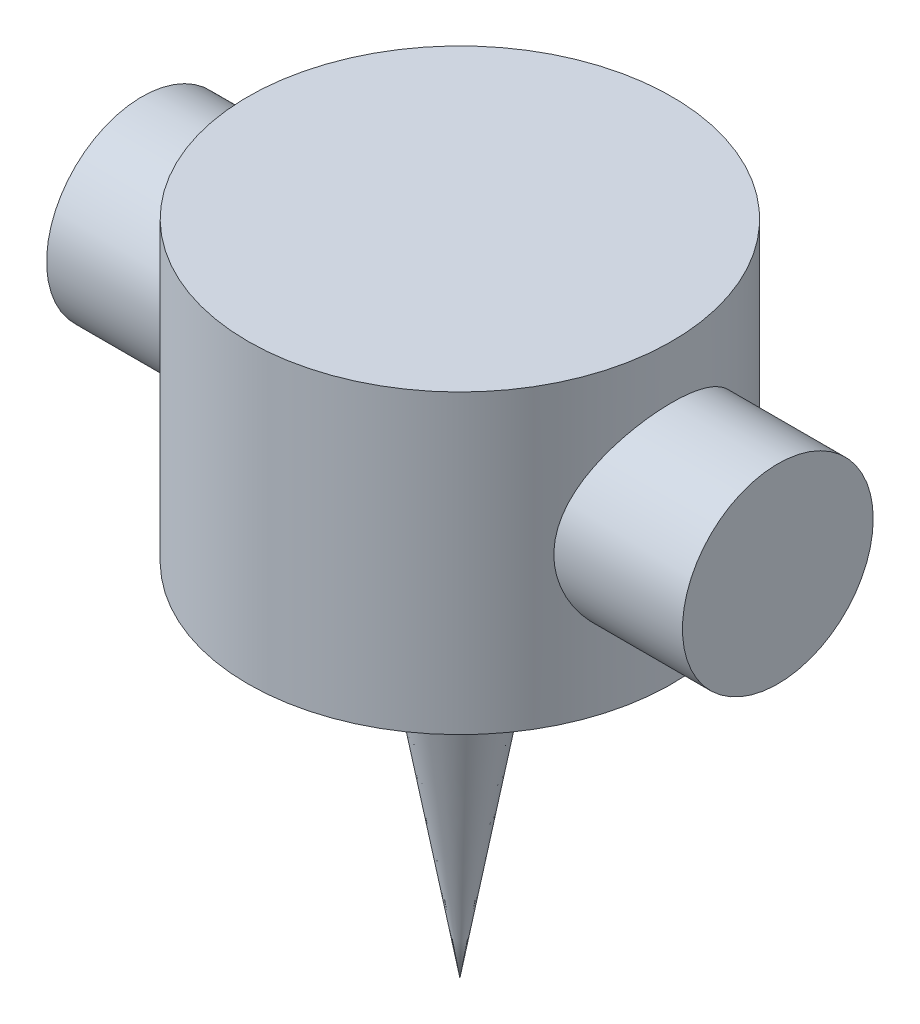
from build123d import *

# Parameters (mm, degrees)
SKETCH1_R                = 50
BOSS_EXTRUDE1_DEPTH      = 70
BOSS_EXTRUDE2_DEPTH      = 75
BOSS_EXTRUDE2_DEPTH_BACK = 75
SKETCH2_R                = 22.5


with BuildPart() as part:
    # Sketch1 → Boss-Extrude1 (new body)
    with BuildSketch(Plane(origin=(0, 0, 0), x_dir=(1, 0, 0), z_dir=(0, 1, 0))):
        with Locations(Location((0, 0, 0), (0, 0, 270))):
            Circle(SKETCH1_R)
    extrude(amount=BOSS_EXTRUDE1_DEPTH)

    # Sketch2 → Boss-Extrude2 (add, two sides: drawn at the far end of the back side and taken through both)
    with BuildSketch(Plane(origin=(0, 0, 0), x_dir=(0, 0, -1), z_dir=(1, 0, 0)).offset(-BOSS_EXTRUDE2_DEPTH_BACK)):
        with Locations((0, 35)):
            Circle(SKETCH2_R)
    extrude(amount=BOSS_EXTRUDE2_DEPTH + BOSS_EXTRUDE2_DEPTH_BACK)

    # Boss-Extrude3 cone 1 section (on through the dimple's axis) → Boss-Extrude3 (revolve)
    with BuildSketch(Plane(origin=(0, 0, 0), x_dir=(0, 0, 1), z_dir=(1, 0, 0))):
        Polygon((0, 0), (15, 0), (0, 85.069227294), align=None)
    revolve(axis=Axis((0, 0, 0), (0, -1, 0)))


solid = part.part
